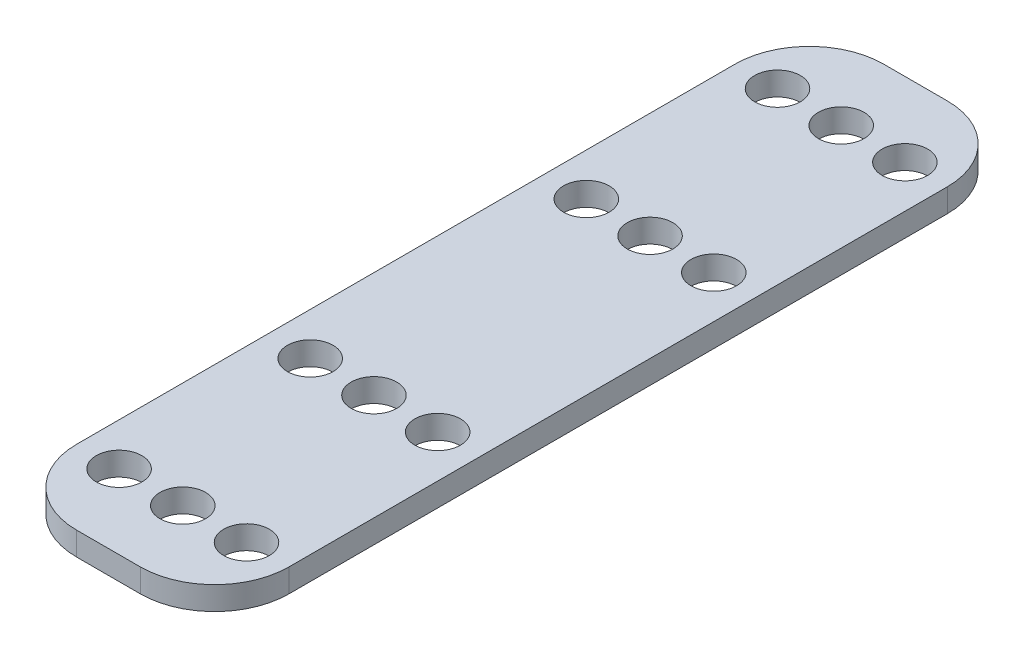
ISO-10303-21;
HEADER;
FILE_DESCRIPTION(('STEP AP214'),'2;1');
FILE_NAME('part.step','',(''),(''),'','','');
FILE_SCHEMA(('AUTOMOTIVE_DESIGN { 1 0 10303 214 1 1 1 1 }'));
ENDSEC;
DATA;
#1=APPLICATION_CONTEXT('core data for automotive mechanical design processes');
#2=APPLICATION_PROTOCOL_DEFINITION('international standard','automotive_design',2000,#1);
#3=PRODUCT_CONTEXT('',#1,'mechanical');
#4=PRODUCT('Part','Part','',(#3));
#5=PRODUCT_RELATED_PRODUCT_CATEGORY('part','',(#4));
#6=PRODUCT_DEFINITION_FORMATION('','',#4);
#7=PRODUCT_DEFINITION_CONTEXT('part definition',#1,'design');
#8=PRODUCT_DEFINITION('design','',#6,#7);
#9=PRODUCT_DEFINITION_SHAPE('','',#8);
#10=(LENGTH_UNIT() NAMED_UNIT(*) SI_UNIT(.MILLI.,.METRE.));
#11=(NAMED_UNIT(*) PLANE_ANGLE_UNIT() SI_UNIT($,.RADIAN.));
#12=(NAMED_UNIT(*) SI_UNIT($,.STERADIAN.) SOLID_ANGLE_UNIT());
#13=UNCERTAINTY_MEASURE_WITH_UNIT(LENGTH_MEASURE(1.E-05),#10,'distance_accuracy_value','');
#14=(GEOMETRIC_REPRESENTATION_CONTEXT(3) GLOBAL_UNCERTAINTY_ASSIGNED_CONTEXT((#13)) GLOBAL_UNIT_ASSIGNED_CONTEXT((#10,
#11,#12)) REPRESENTATION_CONTEXT('',''));
#15=CARTESIAN_POINT('',(0.,0.,0.));
#16=DIRECTION('',(0.,0.,1.));
#17=DIRECTION('',(1.,0.,0.));
#18=AXIS2_PLACEMENT_3D('',#15,#16,#17);
#19=CARTESIAN_POINT('',(7.,2.2,-7.));
#20=DIRECTION('',(0.,-1.,0.));
#21=DIRECTION('',(0.,0.,-1.));
#22=AXIS2_PLACEMENT_3D('',#19,#20,#21);
#23=PLANE('',#22);
#24=CARTESIAN_POINT('',(7.,2.2,-7.));
#25=DIRECTION('',(0.,1.,0.));
#26=DIRECTION('',(0.,0.,-1.));
#27=AXIS2_PLACEMENT_3D('',#24,#25,#26);
#28=CIRCLE('',#27,7.);
#29=CARTESIAN_POINT('',(0.,2.2,-7.00000000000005));
#30=VERTEX_POINT('',#29);
#31=CARTESIAN_POINT('',(7.00000000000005,2.2,0.));
#32=VERTEX_POINT('',#31);
#33=EDGE_CURVE('E146',#30,#32,#28,.T.);
#34=ORIENTED_EDGE('',*,*,#33,.T.);
#35=DIRECTION('',(1.,0.,0.));
#36=VECTOR('',#35,1.);
#37=CARTESIAN_POINT('',(7.00000000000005,2.2,0.));
#38=LINE('',#37,#36);
#39=CARTESIAN_POINT('',(13.,2.2,0.));
#40=VERTEX_POINT('',#39);
#41=EDGE_CURVE('E94',#32,#40,#38,.T.);
#42=ORIENTED_EDGE('',*,*,#41,.T.);
#43=CARTESIAN_POINT('',(13.,2.2,-7.));
#44=DIRECTION('',(0.,1.,0.));
#45=DIRECTION('',(0.,0.,1.));
#46=AXIS2_PLACEMENT_3D('',#43,#44,#45);
#47=CIRCLE('',#46,7.);
#48=CARTESIAN_POINT('',(20.,2.2,-7.00000000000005));
#49=VERTEX_POINT('',#48);
#50=EDGE_CURVE('E161',#40,#49,#47,.T.);
#51=ORIENTED_EDGE('',*,*,#50,.T.);
#52=DIRECTION('',(0.,0.,-1.));
#53=VECTOR('',#52,1.);
#54=CARTESIAN_POINT('',(20.,2.2,-7.00000000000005));
#55=LINE('',#54,#53);
#56=CARTESIAN_POINT('',(20.,2.2,-68.9999999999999));
#57=VERTEX_POINT('',#56);
#58=EDGE_CURVE('E174',#49,#57,#55,.T.);
#59=ORIENTED_EDGE('',*,*,#58,.T.);
#60=CARTESIAN_POINT('',(13.,2.2,-69.));
#61=DIRECTION('',(0.,1.,0.));
#62=DIRECTION('',(0.,0.,-1.));
#63=AXIS2_PLACEMENT_3D('',#60,#61,#62);
#64=CIRCLE('',#63,7.);
#65=CARTESIAN_POINT('',(13.,2.2,-76.));
#66=VERTEX_POINT('',#65);
#67=EDGE_CURVE('E113',#57,#66,#64,.T.);
#68=ORIENTED_EDGE('',*,*,#67,.T.);
#69=DIRECTION('',(-1.,0.,0.));
#70=VECTOR('',#69,1.);
#71=CARTESIAN_POINT('',(7.00000000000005,2.2,-76.));
#72=LINE('',#71,#70);
#73=CARTESIAN_POINT('',(7.00000000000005,2.2,-76.));
#74=VERTEX_POINT('',#73);
#75=EDGE_CURVE('E107',#66,#74,#72,.T.);
#76=ORIENTED_EDGE('',*,*,#75,.T.);
#77=CARTESIAN_POINT('',(7.,2.2,-69.));
#78=DIRECTION('',(0.,1.,0.));
#79=DIRECTION('',(0.,0.,-1.));
#80=AXIS2_PLACEMENT_3D('',#77,#78,#79);
#81=CIRCLE('',#80,7.);
#82=CARTESIAN_POINT('',(0.,2.2,-68.9999999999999));
#83=VERTEX_POINT('',#82);
#84=EDGE_CURVE('E111',#74,#83,#81,.T.);
#85=ORIENTED_EDGE('',*,*,#84,.T.);
#86=DIRECTION('',(0.,0.,1.));
#87=VECTOR('',#86,1.);
#88=CARTESIAN_POINT('',(0.,2.2,-7.00000000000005));
#89=LINE('',#88,#87);
#90=EDGE_CURVE('E51',#83,#30,#89,.T.);
#91=ORIENTED_EDGE('',*,*,#90,.T.);
#92=EDGE_LOOP('',(#34,#42,#51,#59,#68,#76,#85,#91));
#93=FACE_BOUND('',#92,.T.);
#94=CARTESIAN_POINT('',(4.,2.2,-69.));
#95=DIRECTION('',(0.,1.,0.));
#96=DIRECTION('',(0.,0.,1.));
#97=AXIS2_PLACEMENT_3D('',#94,#95,#96);
#98=CIRCLE('',#97,2.15);
#99=CARTESIAN_POINT('',(4.,2.2,-66.85));
#100=VERTEX_POINT('',#99);
#101=EDGE_CURVE('E135',#100,#100,#98,.T.);
#102=ORIENTED_EDGE('',*,*,#101,.F.);
#103=EDGE_LOOP('',(#102));
#104=FACE_BOUND('',#103,.T.);
#105=CARTESIAN_POINT('',(10.,2.2,-69.));
#106=DIRECTION('',(0.,1.,0.));
#107=DIRECTION('',(0.,0.,1.));
#108=AXIS2_PLACEMENT_3D('',#105,#106,#107);
#109=CIRCLE('',#108,2.15);
#110=CARTESIAN_POINT('',(10.,2.2,-66.85));
#111=VERTEX_POINT('',#110);
#112=EDGE_CURVE('E183',#111,#111,#109,.T.);
#113=ORIENTED_EDGE('',*,*,#112,.F.);
#114=EDGE_LOOP('',(#113));
#115=FACE_BOUND('',#114,.T.);
#116=CARTESIAN_POINT('',(16.,2.2,-69.));
#117=DIRECTION('',(0.,1.,0.));
#118=DIRECTION('',(0.,0.,1.));
#119=AXIS2_PLACEMENT_3D('',#116,#117,#118);
#120=CIRCLE('',#119,2.15);
#121=CARTESIAN_POINT('',(16.,2.2,-66.85));
#122=VERTEX_POINT('',#121);
#123=EDGE_CURVE('E189',#122,#122,#120,.T.);
#124=ORIENTED_EDGE('',*,*,#123,.F.);
#125=EDGE_LOOP('',(#124));
#126=FACE_BOUND('',#125,.T.);
#127=CARTESIAN_POINT('',(10.0000000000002,2.2,-51.));
#128=DIRECTION('',(0.,1.,0.));
#129=DIRECTION('',(0.,0.,1.));
#130=AXIS2_PLACEMENT_3D('',#127,#128,#129);
#131=CIRCLE('',#130,2.15);
#132=CARTESIAN_POINT('',(10.0000000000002,2.2,-48.85));
#133=VERTEX_POINT('',#132);
#134=EDGE_CURVE('E195',#133,#133,#131,.T.);
#135=ORIENTED_EDGE('',*,*,#134,.F.);
#136=EDGE_LOOP('',(#135));
#137=FACE_BOUND('',#136,.T.);
#138=CARTESIAN_POINT('',(16.0000000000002,2.2,-51.));
#139=DIRECTION('',(0.,1.,0.));
#140=DIRECTION('',(0.,0.,1.));
#141=AXIS2_PLACEMENT_3D('',#138,#139,#140);
#142=CIRCLE('',#141,2.15);
#143=CARTESIAN_POINT('',(16.0000000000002,2.2,-48.85));
#144=VERTEX_POINT('',#143);
#145=EDGE_CURVE('E201',#144,#144,#142,.T.);
#146=ORIENTED_EDGE('',*,*,#145,.F.);
#147=EDGE_LOOP('',(#146));
#148=FACE_BOUND('',#147,.T.);
#149=CARTESIAN_POINT('',(4.00000000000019,2.2,-51.));
#150=DIRECTION('',(0.,1.,0.));
#151=DIRECTION('',(0.,0.,1.));
#152=AXIS2_PLACEMENT_3D('',#149,#150,#151);
#153=CIRCLE('',#152,2.15);
#154=CARTESIAN_POINT('',(4.00000000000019,2.2,-48.85));
#155=VERTEX_POINT('',#154);
#156=EDGE_CURVE('E207',#155,#155,#153,.T.);
#157=ORIENTED_EDGE('',*,*,#156,.F.);
#158=EDGE_LOOP('',(#157));
#159=FACE_BOUND('',#158,.T.);
#160=CARTESIAN_POINT('',(16.,2.2,-7.00000000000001));
#161=DIRECTION('',(0.,1.,0.));
#162=DIRECTION('',(0.,0.,-1.));
#163=AXIS2_PLACEMENT_3D('',#160,#161,#162);
#164=CIRCLE('',#163,2.15);
#165=CARTESIAN_POINT('',(16.,2.2,-9.15000000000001));
#166=VERTEX_POINT('',#165);
#167=EDGE_CURVE('E213',#166,#166,#164,.T.);
#168=ORIENTED_EDGE('',*,*,#167,.F.);
#169=EDGE_LOOP('',(#168));
#170=FACE_BOUND('',#169,.T.);
#171=CARTESIAN_POINT('',(10.,2.2,-7.00000000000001));
#172=DIRECTION('',(0.,1.,0.));
#173=DIRECTION('',(0.,0.,-1.));
#174=AXIS2_PLACEMENT_3D('',#171,#172,#173);
#175=CIRCLE('',#174,2.15);
#176=CARTESIAN_POINT('',(10.,2.2,-9.15000000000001));
#177=VERTEX_POINT('',#176);
#178=EDGE_CURVE('E219',#177,#177,#175,.T.);
#179=ORIENTED_EDGE('',*,*,#178,.F.);
#180=EDGE_LOOP('',(#179));
#181=FACE_BOUND('',#180,.T.);
#182=CARTESIAN_POINT('',(4.,2.2,-7.00000000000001));
#183=DIRECTION('',(0.,1.,0.));
#184=DIRECTION('',(0.,0.,-1.));
#185=AXIS2_PLACEMENT_3D('',#182,#183,#184);
#186=CIRCLE('',#185,2.15);
#187=CARTESIAN_POINT('',(4.,2.2,-9.15000000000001));
#188=VERTEX_POINT('',#187);
#189=EDGE_CURVE('E225',#188,#188,#186,.T.);
#190=ORIENTED_EDGE('',*,*,#189,.F.);
#191=EDGE_LOOP('',(#190));
#192=FACE_BOUND('',#191,.T.);
#193=CARTESIAN_POINT('',(4.00000000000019,2.2,-25.));
#194=DIRECTION('',(0.,1.,0.));
#195=DIRECTION('',(0.,0.,-1.));
#196=AXIS2_PLACEMENT_3D('',#193,#194,#195);
#197=CIRCLE('',#196,2.15);
#198=CARTESIAN_POINT('',(4.00000000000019,2.2,-27.15));
#199=VERTEX_POINT('',#198);
#200=EDGE_CURVE('E231',#199,#199,#197,.T.);
#201=ORIENTED_EDGE('',*,*,#200,.F.);
#202=EDGE_LOOP('',(#201));
#203=FACE_BOUND('',#202,.T.);
#204=CARTESIAN_POINT('',(10.0000000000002,2.2,-25.));
#205=DIRECTION('',(0.,1.,0.));
#206=DIRECTION('',(0.,0.,-1.));
#207=AXIS2_PLACEMENT_3D('',#204,#205,#206);
#208=CIRCLE('',#207,2.15);
#209=CARTESIAN_POINT('',(10.0000000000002,2.2,-27.15));
#210=VERTEX_POINT('',#209);
#211=EDGE_CURVE('E237',#210,#210,#208,.T.);
#212=ORIENTED_EDGE('',*,*,#211,.F.);
#213=EDGE_LOOP('',(#212));
#214=FACE_BOUND('',#213,.T.);
#215=CARTESIAN_POINT('',(16.0000000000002,2.2,-25.));
#216=DIRECTION('',(0.,1.,0.));
#217=DIRECTION('',(0.,0.,-1.));
#218=AXIS2_PLACEMENT_3D('',#215,#216,#217);
#219=CIRCLE('',#218,2.15);
#220=CARTESIAN_POINT('',(16.0000000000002,2.2,-27.15));
#221=VERTEX_POINT('',#220);
#222=EDGE_CURVE('E243',#221,#221,#219,.T.);
#223=ORIENTED_EDGE('',*,*,#222,.F.);
#224=EDGE_LOOP('',(#223));
#225=FACE_BOUND('',#224,.T.);
#226=ADVANCED_FACE('F34',(#93,#104,#115,#126,#137,#148,#159,#170,#181,#192,#203,#214,#225),#23,.F.);
#227=CARTESIAN_POINT('',(7.,0.,-7.));
#228=DIRECTION('',(0.,-1.,0.));
#229=DIRECTION('',(0.,0.,-1.));
#230=AXIS2_PLACEMENT_3D('',#227,#228,#229);
#231=PLANE('',#230);
#232=CARTESIAN_POINT('',(10.0000000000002,0.,-25.));
#233=DIRECTION('',(0.,1.,0.));
#234=DIRECTION('',(0.,0.,-1.));
#235=AXIS2_PLACEMENT_3D('',#232,#233,#234);
#236=CIRCLE('',#235,2.15);
#237=CARTESIAN_POINT('',(10.0000000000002,0.,-27.15));
#238=VERTEX_POINT('',#237);
#239=EDGE_CURVE('E240',#238,#238,#236,.T.);
#240=ORIENTED_EDGE('',*,*,#239,.T.);
#241=EDGE_LOOP('',(#240));
#242=FACE_BOUND('',#241,.T.);
#243=CARTESIAN_POINT('',(4.,0.,-7.00000000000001));
#244=DIRECTION('',(0.,1.,0.));
#245=DIRECTION('',(0.,0.,-1.));
#246=AXIS2_PLACEMENT_3D('',#243,#244,#245);
#247=CIRCLE('',#246,2.15);
#248=CARTESIAN_POINT('',(4.,0.,-9.15000000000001));
#249=VERTEX_POINT('',#248);
#250=EDGE_CURVE('E228',#249,#249,#247,.T.);
#251=ORIENTED_EDGE('',*,*,#250,.T.);
#252=EDGE_LOOP('',(#251));
#253=FACE_BOUND('',#252,.T.);
#254=CARTESIAN_POINT('',(16.,0.,-7.00000000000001));
#255=DIRECTION('',(0.,1.,0.));
#256=DIRECTION('',(0.,0.,-1.));
#257=AXIS2_PLACEMENT_3D('',#254,#255,#256);
#258=CIRCLE('',#257,2.15);
#259=CARTESIAN_POINT('',(16.,0.,-9.15000000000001));
#260=VERTEX_POINT('',#259);
#261=EDGE_CURVE('E216',#260,#260,#258,.T.);
#262=ORIENTED_EDGE('',*,*,#261,.T.);
#263=EDGE_LOOP('',(#262));
#264=FACE_BOUND('',#263,.T.);
#265=CARTESIAN_POINT('',(16.0000000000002,0.,-51.));
#266=DIRECTION('',(0.,1.,0.));
#267=DIRECTION('',(0.,0.,1.));
#268=AXIS2_PLACEMENT_3D('',#265,#266,#267);
#269=CIRCLE('',#268,2.15);
#270=CARTESIAN_POINT('',(16.0000000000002,0.,-48.85));
#271=VERTEX_POINT('',#270);
#272=EDGE_CURVE('E204',#271,#271,#269,.T.);
#273=ORIENTED_EDGE('',*,*,#272,.T.);
#274=EDGE_LOOP('',(#273));
#275=FACE_BOUND('',#274,.T.);
#276=CARTESIAN_POINT('',(16.,0.,-69.));
#277=DIRECTION('',(0.,1.,0.));
#278=DIRECTION('',(0.,0.,1.));
#279=AXIS2_PLACEMENT_3D('',#276,#277,#278);
#280=CIRCLE('',#279,2.15);
#281=CARTESIAN_POINT('',(16.,0.,-66.85));
#282=VERTEX_POINT('',#281);
#283=EDGE_CURVE('E192',#282,#282,#280,.T.);
#284=ORIENTED_EDGE('',*,*,#283,.T.);
#285=EDGE_LOOP('',(#284));
#286=FACE_BOUND('',#285,.T.);
#287=CARTESIAN_POINT('',(4.,0.,-69.));
#288=DIRECTION('',(0.,1.,0.));
#289=DIRECTION('',(0.,0.,1.));
#290=AXIS2_PLACEMENT_3D('',#287,#288,#289);
#291=CIRCLE('',#290,2.15);
#292=CARTESIAN_POINT('',(4.,0.,-66.85));
#293=VERTEX_POINT('',#292);
#294=EDGE_CURVE('E180',#293,#293,#291,.T.);
#295=ORIENTED_EDGE('',*,*,#294,.T.);
#296=EDGE_LOOP('',(#295));
#297=FACE_BOUND('',#296,.T.);
#298=CARTESIAN_POINT('',(7.,0.,-7.));
#299=DIRECTION('',(0.,1.,0.));
#300=DIRECTION('',(0.,0.,-1.));
#301=AXIS2_PLACEMENT_3D('',#298,#299,#300);
#302=CIRCLE('',#301,7.);
#303=CARTESIAN_POINT('',(0.,0.,-7.00000000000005));
#304=VERTEX_POINT('',#303);
#305=CARTESIAN_POINT('',(7.00000000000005,0.,0.));
#306=VERTEX_POINT('',#305);
#307=EDGE_CURVE('E131',#304,#306,#302,.T.);
#308=ORIENTED_EDGE('',*,*,#307,.F.);
#309=DIRECTION('',(0.,0.,1.));
#310=VECTOR('',#309,1.);
#311=CARTESIAN_POINT('',(0.,0.,-7.00000000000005));
#312=LINE('',#311,#310);
#313=CARTESIAN_POINT('',(0.,0.,-68.9999999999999));
#314=VERTEX_POINT('',#313);
#315=EDGE_CURVE('E86',#314,#304,#312,.T.);
#316=ORIENTED_EDGE('',*,*,#315,.F.);
#317=CARTESIAN_POINT('',(7.,0.,-69.));
#318=DIRECTION('',(0.,1.,0.));
#319=DIRECTION('',(0.,0.,-1.));
#320=AXIS2_PLACEMENT_3D('',#317,#318,#319);
#321=CIRCLE('',#320,7.);
#322=CARTESIAN_POINT('',(7.00000000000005,0.,-76.));
#323=VERTEX_POINT('',#322);
#324=EDGE_CURVE('E80',#323,#314,#321,.T.);
#325=ORIENTED_EDGE('',*,*,#324,.F.);
#326=DIRECTION('',(-1.,0.,0.));
#327=VECTOR('',#326,1.);
#328=CARTESIAN_POINT('',(7.00000000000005,0.,-76.));
#329=LINE('',#328,#327);
#330=CARTESIAN_POINT('',(13.,0.,-76.));
#331=VERTEX_POINT('',#330);
#332=EDGE_CURVE('E121',#331,#323,#329,.T.);
#333=ORIENTED_EDGE('',*,*,#332,.F.);
#334=CARTESIAN_POINT('',(13.,0.,-69.));
#335=DIRECTION('',(0.,1.,0.));
#336=DIRECTION('',(0.,0.,-1.));
#337=AXIS2_PLACEMENT_3D('',#334,#335,#336);
#338=CIRCLE('',#337,7.);
#339=CARTESIAN_POINT('',(20.,0.,-68.9999999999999));
#340=VERTEX_POINT('',#339);
#341=EDGE_CURVE('E141',#340,#331,#338,.T.);
#342=ORIENTED_EDGE('',*,*,#341,.F.);
#343=DIRECTION('',(0.,0.,-1.));
#344=VECTOR('',#343,1.);
#345=CARTESIAN_POINT('',(20.,0.,-7.00000000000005));
#346=LINE('',#345,#344);
#347=CARTESIAN_POINT('',(20.,0.,-7.00000000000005));
#348=VERTEX_POINT('',#347);
#349=EDGE_CURVE('E139',#348,#340,#346,.T.);
#350=ORIENTED_EDGE('',*,*,#349,.F.);
#351=CARTESIAN_POINT('',(13.,0.,-7.));
#352=DIRECTION('',(0.,1.,0.));
#353=DIRECTION('',(0.,0.,1.));
#354=AXIS2_PLACEMENT_3D('',#351,#352,#353);
#355=CIRCLE('',#354,7.);
#356=CARTESIAN_POINT('',(13.,0.,0.));
#357=VERTEX_POINT('',#356);
#358=EDGE_CURVE('E137',#357,#348,#355,.T.);
#359=ORIENTED_EDGE('',*,*,#358,.F.);
#360=DIRECTION('',(1.,0.,0.));
#361=VECTOR('',#360,1.);
#362=CARTESIAN_POINT('',(7.00000000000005,0.,0.));
#363=LINE('',#362,#361);
#364=EDGE_CURVE('E134',#306,#357,#363,.T.);
#365=ORIENTED_EDGE('',*,*,#364,.F.);
#366=EDGE_LOOP('',(#308,#316,#325,#333,#342,#350,#359,#365));
#367=FACE_BOUND('',#366,.T.);
#368=CARTESIAN_POINT('',(10.,0.,-69.));
#369=DIRECTION('',(0.,1.,0.));
#370=DIRECTION('',(0.,0.,1.));
#371=AXIS2_PLACEMENT_3D('',#368,#369,#370);
#372=CIRCLE('',#371,2.15);
#373=CARTESIAN_POINT('',(10.,0.,-66.85));
#374=VERTEX_POINT('',#373);
#375=EDGE_CURVE('E186',#374,#374,#372,.T.);
#376=ORIENTED_EDGE('',*,*,#375,.T.);
#377=EDGE_LOOP('',(#376));
#378=FACE_BOUND('',#377,.T.);
#379=CARTESIAN_POINT('',(10.0000000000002,0.,-51.));
#380=DIRECTION('',(0.,1.,0.));
#381=DIRECTION('',(0.,0.,1.));
#382=AXIS2_PLACEMENT_3D('',#379,#380,#381);
#383=CIRCLE('',#382,2.15);
#384=CARTESIAN_POINT('',(10.0000000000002,0.,-48.85));
#385=VERTEX_POINT('',#384);
#386=EDGE_CURVE('E198',#385,#385,#383,.T.);
#387=ORIENTED_EDGE('',*,*,#386,.T.);
#388=EDGE_LOOP('',(#387));
#389=FACE_BOUND('',#388,.T.);
#390=CARTESIAN_POINT('',(4.00000000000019,0.,-51.));
#391=DIRECTION('',(0.,1.,0.));
#392=DIRECTION('',(0.,0.,1.));
#393=AXIS2_PLACEMENT_3D('',#390,#391,#392);
#394=CIRCLE('',#393,2.15);
#395=CARTESIAN_POINT('',(4.00000000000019,0.,-48.85));
#396=VERTEX_POINT('',#395);
#397=EDGE_CURVE('E210',#396,#396,#394,.T.);
#398=ORIENTED_EDGE('',*,*,#397,.T.);
#399=EDGE_LOOP('',(#398));
#400=FACE_BOUND('',#399,.T.);
#401=CARTESIAN_POINT('',(10.,0.,-7.00000000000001));
#402=DIRECTION('',(0.,1.,0.));
#403=DIRECTION('',(0.,0.,-1.));
#404=AXIS2_PLACEMENT_3D('',#401,#402,#403);
#405=CIRCLE('',#404,2.15);
#406=CARTESIAN_POINT('',(10.,0.,-9.15000000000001));
#407=VERTEX_POINT('',#406);
#408=EDGE_CURVE('E222',#407,#407,#405,.T.);
#409=ORIENTED_EDGE('',*,*,#408,.T.);
#410=EDGE_LOOP('',(#409));
#411=FACE_BOUND('',#410,.T.);
#412=CARTESIAN_POINT('',(4.00000000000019,0.,-25.));
#413=DIRECTION('',(0.,1.,0.));
#414=DIRECTION('',(0.,0.,-1.));
#415=AXIS2_PLACEMENT_3D('',#412,#413,#414);
#416=CIRCLE('',#415,2.15);
#417=CARTESIAN_POINT('',(4.00000000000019,0.,-27.15));
#418=VERTEX_POINT('',#417);
#419=EDGE_CURVE('E234',#418,#418,#416,.T.);
#420=ORIENTED_EDGE('',*,*,#419,.T.);
#421=EDGE_LOOP('',(#420));
#422=FACE_BOUND('',#421,.T.);
#423=CARTESIAN_POINT('',(16.0000000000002,0.,-25.));
#424=DIRECTION('',(0.,1.,0.));
#425=DIRECTION('',(0.,0.,-1.));
#426=AXIS2_PLACEMENT_3D('',#423,#424,#425);
#427=CIRCLE('',#426,2.15);
#428=CARTESIAN_POINT('',(16.0000000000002,0.,-27.15));
#429=VERTEX_POINT('',#428);
#430=EDGE_CURVE('E246',#429,#429,#427,.T.);
#431=ORIENTED_EDGE('',*,*,#430,.T.);
#432=EDGE_LOOP('',(#431));
#433=FACE_BOUND('',#432,.T.);
#434=ADVANCED_FACE('F165',(#242,#253,#264,#275,#286,#297,#367,#378,#389,#400,#411,#422,#433),
#231,.T.);
#435=CARTESIAN_POINT('',(7.,2.2,-7.));
#436=DIRECTION('',(0.,-1.,0.));
#437=DIRECTION('',(0.,0.,-1.));
#438=AXIS2_PLACEMENT_3D('',#435,#436,#437);
#439=CYLINDRICAL_SURFACE('',#438,7.);
#440=ORIENTED_EDGE('',*,*,#307,.T.);
#441=DIRECTION('',(0.,-1.,0.));
#442=VECTOR('',#441,1.);
#443=CARTESIAN_POINT('',(7.00000000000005,2.2,0.));
#444=LINE('',#443,#442);
#445=EDGE_CURVE('E11',#32,#306,#444,.T.);
#446=ORIENTED_EDGE('',*,*,#445,.F.);
#447=ORIENTED_EDGE('',*,*,#33,.F.);
#448=DIRECTION('',(0.,-1.,0.));
#449=VECTOR('',#448,1.);
#450=CARTESIAN_POINT('',(0.,2.2,-7.00000000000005));
#451=LINE('',#450,#449);
#452=EDGE_CURVE('E127',#30,#304,#451,.T.);
#453=ORIENTED_EDGE('',*,*,#452,.T.);
#454=EDGE_LOOP('',(#440,#446,#447,#453));
#455=FACE_BOUND('',#454,.T.);
#456=ADVANCED_FACE('F36',(#455),#439,.T.);
#457=CARTESIAN_POINT('',(7.00000000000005,2.2,0.));
#458=DIRECTION('',(0.,0.,-1.));
#459=DIRECTION('',(-1.,0.,0.));
#460=AXIS2_PLACEMENT_3D('',#457,#458,#459);
#461=PLANE('',#460);
#462=ORIENTED_EDGE('',*,*,#364,.T.);
#463=DIRECTION('',(0.,-1.,0.));
#464=VECTOR('',#463,1.);
#465=CARTESIAN_POINT('',(13.,2.2,0.));
#466=LINE('',#465,#464);
#467=EDGE_CURVE('E43',#40,#357,#466,.T.);
#468=ORIENTED_EDGE('',*,*,#467,.F.);
#469=ORIENTED_EDGE('',*,*,#41,.F.);
#470=ORIENTED_EDGE('',*,*,#445,.T.);
#471=EDGE_LOOP('',(#462,#468,#469,#470));
#472=FACE_BOUND('',#471,.T.);
#473=ADVANCED_FACE('F278',(#472),#461,.F.);
#474=CARTESIAN_POINT('',(13.,2.2,-7.));
#475=DIRECTION('',(0.,-1.,0.));
#476=DIRECTION('',(0.,0.,-1.));
#477=AXIS2_PLACEMENT_3D('',#474,#475,#476);
#478=CYLINDRICAL_SURFACE('',#477,7.);
#479=ORIENTED_EDGE('',*,*,#358,.T.);
#480=DIRECTION('',(0.,-1.,0.));
#481=VECTOR('',#480,1.);
#482=CARTESIAN_POINT('',(20.,2.2,-7.00000000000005));
#483=LINE('',#482,#481);
#484=EDGE_CURVE('E153',#49,#348,#483,.T.);
#485=ORIENTED_EDGE('',*,*,#484,.F.);
#486=ORIENTED_EDGE('',*,*,#50,.F.);
#487=ORIENTED_EDGE('',*,*,#467,.T.);
#488=EDGE_LOOP('',(#479,#485,#486,#487));
#489=FACE_BOUND('',#488,.T.);
#490=ADVANCED_FACE('F159',(#489),#478,.T.);
#491=CARTESIAN_POINT('',(20.,2.2,-7.00000000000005));
#492=DIRECTION('',(-1.,0.,0.));
#493=DIRECTION('',(0.,0.,1.));
#494=AXIS2_PLACEMENT_3D('',#491,#492,#493);
#495=PLANE('',#494);
#496=ORIENTED_EDGE('',*,*,#349,.T.);
#497=DIRECTION('',(0.,-1.,0.));
#498=VECTOR('',#497,1.);
#499=CARTESIAN_POINT('',(20.,2.2,-68.9999999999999));
#500=LINE('',#499,#498);
#501=EDGE_CURVE('E150',#57,#340,#500,.T.);
#502=ORIENTED_EDGE('',*,*,#501,.F.);
#503=ORIENTED_EDGE('',*,*,#58,.F.);
#504=ORIENTED_EDGE('',*,*,#484,.T.);
#505=EDGE_LOOP('',(#496,#502,#503,#504));
#506=FACE_BOUND('',#505,.T.);
#507=ADVANCED_FACE('F170',(#506),#495,.F.);
#508=CARTESIAN_POINT('',(13.,2.2,-69.));
#509=DIRECTION('',(0.,-1.,0.));
#510=DIRECTION('',(0.,0.,-1.));
#511=AXIS2_PLACEMENT_3D('',#508,#509,#510);
#512=CYLINDRICAL_SURFACE('',#511,7.);
#513=ORIENTED_EDGE('',*,*,#341,.T.);
#514=DIRECTION('',(0.,-1.,0.));
#515=VECTOR('',#514,1.);
#516=CARTESIAN_POINT('',(13.,2.2,-76.));
#517=LINE('',#516,#515);
#518=EDGE_CURVE('E122',#66,#331,#517,.T.);
#519=ORIENTED_EDGE('',*,*,#518,.F.);
#520=ORIENTED_EDGE('',*,*,#67,.F.);
#521=ORIENTED_EDGE('',*,*,#501,.T.);
#522=EDGE_LOOP('',(#513,#519,#520,#521));
#523=FACE_BOUND('',#522,.T.);
#524=ADVANCED_FACE('F173',(#523),#512,.T.);
#525=CARTESIAN_POINT('',(7.00000000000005,2.2,-76.));
#526=DIRECTION('',(0.,0.,1.));
#527=DIRECTION('',(1.,0.,0.));
#528=AXIS2_PLACEMENT_3D('',#525,#526,#527);
#529=PLANE('',#528);
#530=ORIENTED_EDGE('',*,*,#332,.T.);
#531=DIRECTION('',(0.,-1.,0.));
#532=VECTOR('',#531,1.);
#533=CARTESIAN_POINT('',(7.00000000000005,2.2,-76.));
#534=LINE('',#533,#532);
#535=EDGE_CURVE('E118',#74,#323,#534,.T.);
#536=ORIENTED_EDGE('',*,*,#535,.F.);
#537=ORIENTED_EDGE('',*,*,#75,.F.);
#538=ORIENTED_EDGE('',*,*,#518,.T.);
#539=EDGE_LOOP('',(#530,#536,#537,#538));
#540=FACE_BOUND('',#539,.T.);
#541=ADVANCED_FACE('F119',(#540),#529,.F.);
#542=CARTESIAN_POINT('',(7.,2.2,-69.));
#543=DIRECTION('',(0.,-1.,0.));
#544=DIRECTION('',(0.,0.,-1.));
#545=AXIS2_PLACEMENT_3D('',#542,#543,#544);
#546=CYLINDRICAL_SURFACE('',#545,7.);
#547=ORIENTED_EDGE('',*,*,#324,.T.);
#548=DIRECTION('',(0.,-1.,0.));
#549=VECTOR('',#548,1.);
#550=CARTESIAN_POINT('',(0.,2.2,-68.9999999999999));
#551=LINE('',#550,#549);
#552=EDGE_CURVE('E123',#83,#314,#551,.T.);
#553=ORIENTED_EDGE('',*,*,#552,.F.);
#554=ORIENTED_EDGE('',*,*,#84,.F.);
#555=ORIENTED_EDGE('',*,*,#535,.T.);
#556=EDGE_LOOP('',(#547,#553,#554,#555));
#557=FACE_BOUND('',#556,.T.);
#558=ADVANCED_FACE('F125',(#557),#546,.T.);
#559=CARTESIAN_POINT('',(0.,2.2,-7.00000000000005));
#560=DIRECTION('',(1.,0.,0.));
#561=DIRECTION('',(0.,0.,-1.));
#562=AXIS2_PLACEMENT_3D('',#559,#560,#561);
#563=PLANE('',#562);
#564=ORIENTED_EDGE('',*,*,#315,.T.);
#565=ORIENTED_EDGE('',*,*,#452,.F.);
#566=ORIENTED_EDGE('',*,*,#90,.F.);
#567=ORIENTED_EDGE('',*,*,#552,.T.);
#568=EDGE_LOOP('',(#564,#565,#566,#567));
#569=FACE_BOUND('',#568,.T.);
#570=ADVANCED_FACE('F266',(#569),#563,.F.);
#571=CARTESIAN_POINT('',(4.,2.2,-69.));
#572=DIRECTION('',(0.,-1.,0.));
#573=DIRECTION('',(0.,0.,-1.));
#574=AXIS2_PLACEMENT_3D('',#571,#572,#573);
#575=CYLINDRICAL_SURFACE('',#574,2.15);
#576=ORIENTED_EDGE('',*,*,#101,.T.);
#577=EDGE_LOOP('',(#576));
#578=FACE_BOUND('',#577,.T.);
#579=ORIENTED_EDGE('',*,*,#294,.F.);
#580=EDGE_LOOP('',(#579));
#581=FACE_BOUND('',#580,.T.);
#582=ADVANCED_FACE('F263',(#578,#581),#575,.F.);
#583=CARTESIAN_POINT('',(10.,2.2,-69.));
#584=DIRECTION('',(0.,-1.,0.));
#585=DIRECTION('',(0.,0.,-1.));
#586=AXIS2_PLACEMENT_3D('',#583,#584,#585);
#587=CYLINDRICAL_SURFACE('',#586,2.15);
#588=ORIENTED_EDGE('',*,*,#112,.T.);
#589=EDGE_LOOP('',(#588));
#590=FACE_BOUND('',#589,.T.);
#591=ORIENTED_EDGE('',*,*,#375,.F.);
#592=EDGE_LOOP('',(#591));
#593=FACE_BOUND('',#592,.T.);
#594=ADVANCED_FACE('F342',(#590,#593),#587,.F.);
#595=CARTESIAN_POINT('',(16.,2.2,-69.));
#596=DIRECTION('',(0.,-1.,0.));
#597=DIRECTION('',(0.,0.,-1.));
#598=AXIS2_PLACEMENT_3D('',#595,#596,#597);
#599=CYLINDRICAL_SURFACE('',#598,2.15);
#600=ORIENTED_EDGE('',*,*,#123,.T.);
#601=EDGE_LOOP('',(#600));
#602=FACE_BOUND('',#601,.T.);
#603=ORIENTED_EDGE('',*,*,#283,.F.);
#604=EDGE_LOOP('',(#603));
#605=FACE_BOUND('',#604,.T.);
#606=ADVANCED_FACE('F350',(#602,#605),#599,.F.);
#607=CARTESIAN_POINT('',(10.0000000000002,2.2,-51.));
#608=DIRECTION('',(0.,-1.,0.));
#609=DIRECTION('',(0.,0.,-1.));
#610=AXIS2_PLACEMENT_3D('',#607,#608,#609);
#611=CYLINDRICAL_SURFACE('',#610,2.15);
#612=ORIENTED_EDGE('',*,*,#134,.T.);
#613=EDGE_LOOP('',(#612));
#614=FACE_BOUND('',#613,.T.);
#615=ORIENTED_EDGE('',*,*,#386,.F.);
#616=EDGE_LOOP('',(#615));
#617=FACE_BOUND('',#616,.T.);
#618=ADVANCED_FACE('F358',(#614,#617),#611,.F.);
#619=CARTESIAN_POINT('',(16.0000000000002,2.2,-51.));
#620=DIRECTION('',(0.,-1.,0.));
#621=DIRECTION('',(0.,0.,-1.));
#622=AXIS2_PLACEMENT_3D('',#619,#620,#621);
#623=CYLINDRICAL_SURFACE('',#622,2.15);
#624=ORIENTED_EDGE('',*,*,#145,.T.);
#625=EDGE_LOOP('',(#624));
#626=FACE_BOUND('',#625,.T.);
#627=ORIENTED_EDGE('',*,*,#272,.F.);
#628=EDGE_LOOP('',(#627));
#629=FACE_BOUND('',#628,.T.);
#630=ADVANCED_FACE('F367',(#626,#629),#623,.F.);
#631=CARTESIAN_POINT('',(4.00000000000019,2.2,-51.));
#632=DIRECTION('',(0.,-1.,0.));
#633=DIRECTION('',(0.,0.,-1.));
#634=AXIS2_PLACEMENT_3D('',#631,#632,#633);
#635=CYLINDRICAL_SURFACE('',#634,2.15);
#636=ORIENTED_EDGE('',*,*,#156,.T.);
#637=EDGE_LOOP('',(#636));
#638=FACE_BOUND('',#637,.T.);
#639=ORIENTED_EDGE('',*,*,#397,.F.);
#640=EDGE_LOOP('',(#639));
#641=FACE_BOUND('',#640,.T.);
#642=ADVANCED_FACE('F376',(#638,#641),#635,.F.);
#643=CARTESIAN_POINT('',(16.,2.2,-7.00000000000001));
#644=DIRECTION('',(0.,-1.,0.));
#645=DIRECTION('',(0.,0.,-1.));
#646=AXIS2_PLACEMENT_3D('',#643,#644,#645);
#647=CYLINDRICAL_SURFACE('',#646,2.15);
#648=ORIENTED_EDGE('',*,*,#167,.T.);
#649=EDGE_LOOP('',(#648));
#650=FACE_BOUND('',#649,.T.);
#651=ORIENTED_EDGE('',*,*,#261,.F.);
#652=EDGE_LOOP('',(#651));
#653=FACE_BOUND('',#652,.T.);
#654=ADVANCED_FACE('F385',(#650,#653),#647,.F.);
#655=CARTESIAN_POINT('',(10.,2.2,-7.00000000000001));
#656=DIRECTION('',(0.,-1.,0.));
#657=DIRECTION('',(0.,0.,-1.));
#658=AXIS2_PLACEMENT_3D('',#655,#656,#657);
#659=CYLINDRICAL_SURFACE('',#658,2.15);
#660=ORIENTED_EDGE('',*,*,#178,.T.);
#661=EDGE_LOOP('',(#660));
#662=FACE_BOUND('',#661,.T.);
#663=ORIENTED_EDGE('',*,*,#408,.F.);
#664=EDGE_LOOP('',(#663));
#665=FACE_BOUND('',#664,.T.);
#666=ADVANCED_FACE('F394',(#662,#665),#659,.F.);
#667=CARTESIAN_POINT('',(4.,2.2,-7.00000000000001));
#668=DIRECTION('',(0.,-1.,0.));
#669=DIRECTION('',(0.,0.,-1.));
#670=AXIS2_PLACEMENT_3D('',#667,#668,#669);
#671=CYLINDRICAL_SURFACE('',#670,2.15);
#672=ORIENTED_EDGE('',*,*,#189,.T.);
#673=EDGE_LOOP('',(#672));
#674=FACE_BOUND('',#673,.T.);
#675=ORIENTED_EDGE('',*,*,#250,.F.);
#676=EDGE_LOOP('',(#675));
#677=FACE_BOUND('',#676,.T.);
#678=ADVANCED_FACE('F403',(#674,#677),#671,.F.);
#679=CARTESIAN_POINT('',(4.00000000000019,2.2,-25.));
#680=DIRECTION('',(0.,-1.,0.));
#681=DIRECTION('',(0.,0.,-1.));
#682=AXIS2_PLACEMENT_3D('',#679,#680,#681);
#683=CYLINDRICAL_SURFACE('',#682,2.15);
#684=ORIENTED_EDGE('',*,*,#200,.T.);
#685=EDGE_LOOP('',(#684));
#686=FACE_BOUND('',#685,.T.);
#687=ORIENTED_EDGE('',*,*,#419,.F.);
#688=EDGE_LOOP('',(#687));
#689=FACE_BOUND('',#688,.T.);
#690=ADVANCED_FACE('F412',(#686,#689),#683,.F.);
#691=CARTESIAN_POINT('',(10.0000000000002,2.2,-25.));
#692=DIRECTION('',(0.,-1.,0.));
#693=DIRECTION('',(0.,0.,-1.));
#694=AXIS2_PLACEMENT_3D('',#691,#692,#693);
#695=CYLINDRICAL_SURFACE('',#694,2.15);
#696=ORIENTED_EDGE('',*,*,#211,.T.);
#697=EDGE_LOOP('',(#696));
#698=FACE_BOUND('',#697,.T.);
#699=ORIENTED_EDGE('',*,*,#239,.F.);
#700=EDGE_LOOP('',(#699));
#701=FACE_BOUND('',#700,.T.);
#702=ADVANCED_FACE('F421',(#698,#701),#695,.F.);
#703=CARTESIAN_POINT('',(16.0000000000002,2.2,-25.));
#704=DIRECTION('',(0.,-1.,0.));
#705=DIRECTION('',(0.,0.,-1.));
#706=AXIS2_PLACEMENT_3D('',#703,#704,#705);
#707=CYLINDRICAL_SURFACE('',#706,2.15);
#708=ORIENTED_EDGE('',*,*,#222,.T.);
#709=EDGE_LOOP('',(#708));
#710=FACE_BOUND('',#709,.T.);
#711=ORIENTED_EDGE('',*,*,#430,.F.);
#712=EDGE_LOOP('',(#711));
#713=FACE_BOUND('',#712,.T.);
#714=ADVANCED_FACE('F252',(#710,#713),#707,.F.);
#715=CLOSED_SHELL('',(#226,#434,#456,#473,#490,#507,#524,#541,#558,#570,#582,#594,#606,#618,
#630,#642,#654,#666,#678,#690,#702,#714));
#716=MANIFOLD_SOLID_BREP('B2',#715);
#717=ADVANCED_BREP_SHAPE_REPRESENTATION('',(#18,#716),#14);
#718=SHAPE_DEFINITION_REPRESENTATION(#9,#717);
ENDSEC;
END-ISO-10303-21;
